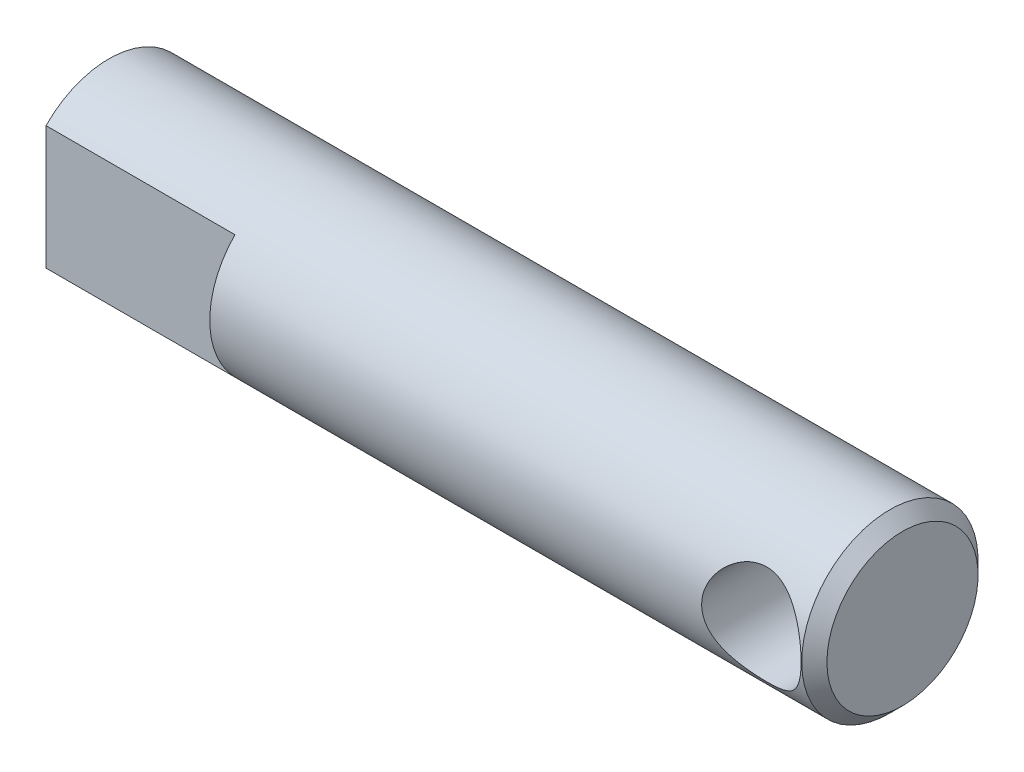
from build123d import *

# Parameters (mm, degrees)
ESQUISSE1_W                  = 63
ESQUISSE1_H                  = 7
CHANFREIN1_SIZE              = 1
ENL_V_MAT_EXTRU_2_DEPTH      = 10
ENL_V_MAT_EXTRU_2_DEPTH_BACK = 10
ESQUISSE2_R                  = 3.95
ESQUISSE3_W                  = 3
ESQUISSE3_H                  = 13
ENL_V_MAT_EXTRU_3_DEPTH      = 15


with BuildPart() as part:
    # Esquisse1 → Base-R_volution (revolve)
    with BuildSketch(Plane.XY, mode=Mode.PRIVATE) as base_r_volution_sk:
        with Locations((-26.5, 3.5)):
            Rectangle(ESQUISSE1_W, ESQUISSE1_H)
    revolve(base_r_volution_sk.sketch.rotate(Axis((9, 0, 0), (-1, 0, 0)), 314.415308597), axis=Axis((9, 0, 0), (-1, 0, 0)))

    # Chanfrein1
    chanfrein1_edges = [part.edges().sort_by_distance(p)[0] for p in [
        (5, -4.898979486, -5),
    ]]
    chamfer(chanfrein1_edges, length=CHANFREIN1_SIZE)

    # Esquisse2 → Enl_v. mat.-Extru.2 (cut, two sides: drawn at the far end of the back side and taken through both)
    with BuildSketch(Plane.XY.offset(-ENL_V_MAT_EXTRU_2_DEPTH_BACK)):
        Circle(ESQUISSE2_R)
    extrude(amount=ENL_V_MAT_EXTRU_2_DEPTH + ENL_V_MAT_EXTRU_2_DEPTH_BACK, mode=Mode.SUBTRACT)

    # Esquisse3 → Enl_v. mat.-Extru.3 (cut)
    with BuildSketch(Plane.ZY.offset(58)):
        with Locations((6.5, 0.5)):
            Rectangle(ESQUISSE3_W, ESQUISSE3_H)
    extrude(amount=-ENL_V_MAT_EXTRU_3_DEPTH, mode=Mode.SUBTRACT)


solid = part.part
